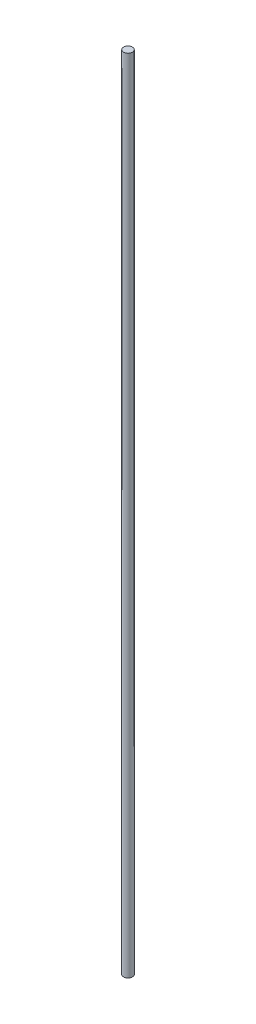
ISO-10303-21;
HEADER;
FILE_DESCRIPTION(('STEP AP214'),'2;1');
FILE_NAME('part.step','',(''),(''),'','','');
FILE_SCHEMA(('AUTOMOTIVE_DESIGN { 1 0 10303 214 1 1 1 1 }'));
ENDSEC;
DATA;
#1=APPLICATION_CONTEXT('core data for automotive mechanical design processes');
#2=APPLICATION_PROTOCOL_DEFINITION('international standard','automotive_design',2000,#1);
#3=PRODUCT_CONTEXT('',#1,'mechanical');
#4=PRODUCT('Part','Part','',(#3));
#5=PRODUCT_RELATED_PRODUCT_CATEGORY('part','',(#4));
#6=PRODUCT_DEFINITION_FORMATION('','',#4);
#7=PRODUCT_DEFINITION_CONTEXT('part definition',#1,'design');
#8=PRODUCT_DEFINITION('design','',#6,#7);
#9=PRODUCT_DEFINITION_SHAPE('','',#8);
#10=(LENGTH_UNIT() NAMED_UNIT(*) SI_UNIT(.MILLI.,.METRE.));
#11=(NAMED_UNIT(*) PLANE_ANGLE_UNIT() SI_UNIT($,.RADIAN.));
#12=(NAMED_UNIT(*) SI_UNIT($,.STERADIAN.) SOLID_ANGLE_UNIT());
#13=UNCERTAINTY_MEASURE_WITH_UNIT(LENGTH_MEASURE(1.E-05),#10,'distance_accuracy_value','');
#14=(GEOMETRIC_REPRESENTATION_CONTEXT(3) GLOBAL_UNCERTAINTY_ASSIGNED_CONTEXT((#13)) GLOBAL_UNIT_ASSIGNED_CONTEXT((#10,
#11,#12)) REPRESENTATION_CONTEXT('',''));
#15=CARTESIAN_POINT('',(0.,0.,0.));
#16=DIRECTION('',(0.,0.,1.));
#17=DIRECTION('',(1.,0.,0.));
#18=AXIS2_PLACEMENT_3D('',#15,#16,#17);
#19=CARTESIAN_POINT('',(0.,720.,0.));
#20=DIRECTION('',(0.,-1.,0.));
#21=DIRECTION('',(0.,0.,-1.));
#22=AXIS2_PLACEMENT_3D('',#19,#20,#21);
#23=CYLINDRICAL_SURFACE('',#22,4.);
#24=CARTESIAN_POINT('',(0.,720.,0.));
#25=DIRECTION('',(0.,1.,0.));
#26=DIRECTION('',(0.,0.,1.));
#27=AXIS2_PLACEMENT_3D('',#24,#25,#26);
#28=CIRCLE('',#27,4.);
#29=CARTESIAN_POINT('',(0.,720.,-4.));
#30=VERTEX_POINT('',#29);
#31=EDGE_CURVE('E10',#30,#30,#28,.T.);
#32=CARTESIAN_POINT('',(0.,0.,0.));
#33=DIRECTION('',(0.,1.,0.));
#34=DIRECTION('',(0.,0.,1.));
#35=AXIS2_PLACEMENT_3D('',#32,#33,#34);
#36=CIRCLE('',#35,4.);
#37=CARTESIAN_POINT('',(0.,-1.11022302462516E-13,-4.));
#38=VERTEX_POINT('',#37);
#39=EDGE_CURVE('E33',#38,#38,#36,.T.);
#40=CARTESIAN_POINT('',(0.,720.,-4.));
#41=CARTESIAN_POINT('',(0.,712.5,-4.));
#42=CARTESIAN_POINT('',(0.,705.,-4.));
#43=CARTESIAN_POINT('',(0.,690.,-4.));
#44=CARTESIAN_POINT('',(0.,682.5,-4.));
#45=CARTESIAN_POINT('',(0.,667.5,-4.));
#46=CARTESIAN_POINT('',(0.,660.,-4.));
#47=CARTESIAN_POINT('',(0.,645.,-4.));
#48=CARTESIAN_POINT('',(0.,637.5,-4.));
#49=CARTESIAN_POINT('',(0.,622.5,-4.));
#50=CARTESIAN_POINT('',(0.,615.,-4.));
#51=CARTESIAN_POINT('',(0.,600.,-4.));
#52=CARTESIAN_POINT('',(0.,592.5,-4.));
#53=CARTESIAN_POINT('',(0.,577.5,-4.));
#54=CARTESIAN_POINT('',(0.,570.,-4.));
#55=CARTESIAN_POINT('',(0.,555.,-4.));
#56=CARTESIAN_POINT('',(0.,547.5,-4.));
#57=CARTESIAN_POINT('',(0.,532.5,-4.));
#58=CARTESIAN_POINT('',(0.,525.,-4.));
#59=CARTESIAN_POINT('',(0.,510.,-4.));
#60=CARTESIAN_POINT('',(0.,502.5,-4.));
#61=CARTESIAN_POINT('',(0.,487.5,-4.));
#62=CARTESIAN_POINT('',(0.,480.,-4.));
#63=CARTESIAN_POINT('',(0.,465.,-4.));
#64=CARTESIAN_POINT('',(0.,457.5,-4.));
#65=CARTESIAN_POINT('',(0.,442.5,-4.));
#66=CARTESIAN_POINT('',(0.,435.,-4.));
#67=CARTESIAN_POINT('',(0.,420.,-4.));
#68=CARTESIAN_POINT('',(0.,412.5,-4.));
#69=CARTESIAN_POINT('',(0.,397.5,-4.));
#70=CARTESIAN_POINT('',(0.,390.,-4.));
#71=CARTESIAN_POINT('',(0.,375.,-4.));
#72=CARTESIAN_POINT('',(0.,367.5,-4.));
#73=CARTESIAN_POINT('',(0.,352.5,-4.));
#74=CARTESIAN_POINT('',(0.,345.,-4.));
#75=CARTESIAN_POINT('',(0.,330.,-4.));
#76=CARTESIAN_POINT('',(0.,322.5,-4.));
#77=CARTESIAN_POINT('',(0.,307.5,-4.));
#78=CARTESIAN_POINT('',(0.,300.,-4.));
#79=CARTESIAN_POINT('',(0.,285.,-4.));
#80=CARTESIAN_POINT('',(0.,277.5,-4.));
#81=CARTESIAN_POINT('',(0.,262.5,-4.));
#82=CARTESIAN_POINT('',(0.,255.,-4.));
#83=CARTESIAN_POINT('',(0.,240.,-4.));
#84=CARTESIAN_POINT('',(0.,232.5,-4.));
#85=CARTESIAN_POINT('',(0.,217.5,-4.));
#86=CARTESIAN_POINT('',(0.,210.,-4.));
#87=CARTESIAN_POINT('',(0.,195.,-4.));
#88=CARTESIAN_POINT('',(0.,187.5,-4.));
#89=CARTESIAN_POINT('',(0.,172.5,-4.));
#90=CARTESIAN_POINT('',(0.,165.,-4.));
#91=CARTESIAN_POINT('',(0.,150.,-4.));
#92=CARTESIAN_POINT('',(0.,142.5,-4.));
#93=CARTESIAN_POINT('',(0.,127.5,-4.));
#94=CARTESIAN_POINT('',(0.,120.,-4.));
#95=CARTESIAN_POINT('',(0.,105.,-4.));
#96=CARTESIAN_POINT('',(0.,97.5,-4.));
#97=CARTESIAN_POINT('',(0.,82.4999999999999,-4.));
#98=CARTESIAN_POINT('',(0.,74.9999999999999,-4.));
#99=CARTESIAN_POINT('',(0.,59.9999999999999,-4.));
#100=CARTESIAN_POINT('',(0.,52.4999999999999,-4.));
#101=CARTESIAN_POINT('',(0.,37.4999999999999,-4.));
#102=CARTESIAN_POINT('',(0.,29.9999999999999,-4.));
#103=CARTESIAN_POINT('',(0.,14.9999999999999,-4.));
#104=CARTESIAN_POINT('',(0.,7.49999999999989,-4.));
#105=CARTESIAN_POINT('',(0.,-1.11022302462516E-13,-4.));
#106=B_SPLINE_CURVE_WITH_KNOTS('',3,(#40,#41,#42,#43,#44,#45,#46,#47,#48,#49,#50,#51,#52,#53,
#54,#55,#56,#57,#58,#59,#60,#61,#62,#63,#64,#65,#66,#67,#68,#69,#70,#71,#72,#73,#74,#75,#76,#77,
#78,#79,#80,#81,#82,#83,#84,#85,#86,#87,#88,#89,#90,#91,#92,#93,#94,#95,#96,#97,#98,#99,#100,
#101,#102,#103,#104,#105),.UNSPECIFIED.,.F.,.F.,(4,2,2,2,2,2,2,2,2,2,2,2,2,2,2,2,2,2,2,2,2,2,2,
2,2,2,2,2,2,2,2,2,4),(0.,22.5000000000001,45.,67.5000000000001,90.0000000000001,112.5,135.,
157.5,180.,202.5,225.,247.5,270.,292.5,315.,337.5,360.,382.5,405.,427.5,450.,472.5,495.,517.5,
540.,562.5,585.,607.5,630.,652.5,675.,697.5,720.),.UNSPECIFIED.);
#107=EDGE_CURVE('BSEAM30',#30,#38,#106,.T.);
#108=ORIENTED_EDGE('',*,*,#31,.F.);
#109=ORIENTED_EDGE('',*,*,#39,.T.);
#110=ORIENTED_EDGE('',*,*,#107,.T.);
#111=ORIENTED_EDGE('',*,*,#107,.F.);
#112=EDGE_LOOP('',(#108,#110,#109,#111));
#113=FACE_BOUND('',#112,.T.);
#114=ADVANCED_FACE('F30',(#113),#23,.T.);
#115=CARTESIAN_POINT('',(0.,720.,0.));
#116=DIRECTION('',(0.,1.,0.));
#117=DIRECTION('',(0.,0.,1.));
#118=AXIS2_PLACEMENT_3D('',#115,#116,#117);
#119=PLANE('',#118);
#120=ORIENTED_EDGE('',*,*,#31,.T.);
#121=EDGE_LOOP('',(#120));
#122=FACE_BOUND('',#121,.T.);
#123=ADVANCED_FACE('F45',(#122),#119,.T.);
#124=CARTESIAN_POINT('',(0.,0.,0.));
#125=DIRECTION('',(0.,1.,0.));
#126=DIRECTION('',(0.,0.,1.));
#127=AXIS2_PLACEMENT_3D('',#124,#125,#126);
#128=PLANE('',#127);
#129=ORIENTED_EDGE('',*,*,#39,.F.);
#130=EDGE_LOOP('',(#129));
#131=FACE_BOUND('',#130,.T.);
#132=ADVANCED_FACE('F43',(#131),#128,.F.);
#133=CLOSED_SHELL('',(#114,#123,#132));
#134=MANIFOLD_SOLID_BREP('B2',#133);
#135=ADVANCED_BREP_SHAPE_REPRESENTATION('',(#18,#134),#14);
#136=SHAPE_DEFINITION_REPRESENTATION(#9,#135);
ENDSEC;
END-ISO-10303-21;
